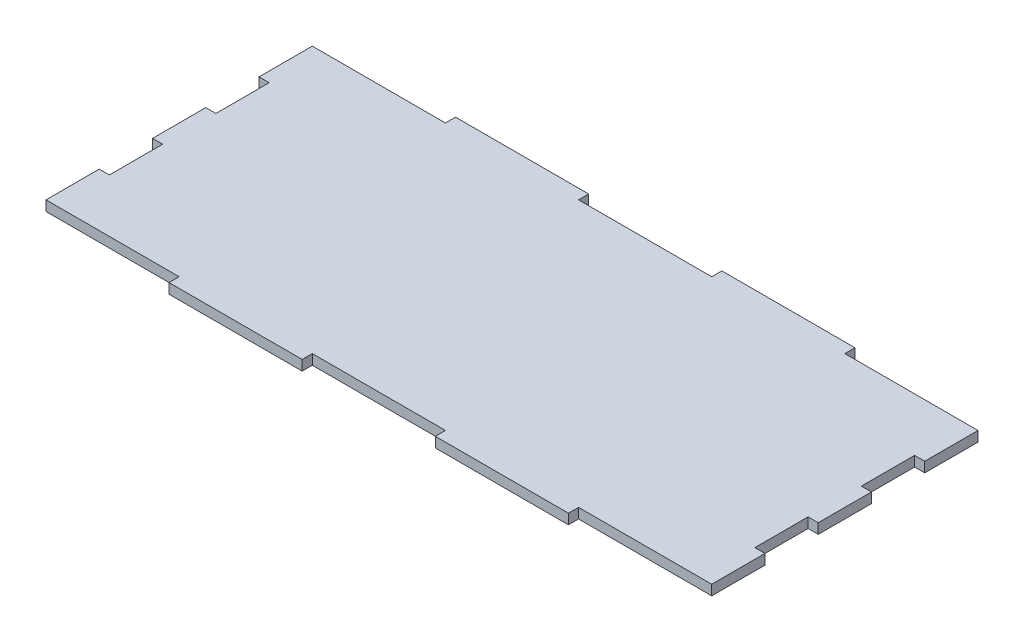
ISO-10303-21;
HEADER;
FILE_DESCRIPTION(('STEP AP214'),'2;1');
FILE_NAME('part.step','',(''),(''),'','','');
FILE_SCHEMA(('AUTOMOTIVE_DESIGN { 1 0 10303 214 1 1 1 1 }'));
ENDSEC;
DATA;
#1=APPLICATION_CONTEXT('core data for automotive mechanical design processes');
#2=APPLICATION_PROTOCOL_DEFINITION('international standard','automotive_design',2000,#1);
#3=PRODUCT_CONTEXT('',#1,'mechanical');
#4=PRODUCT('Part','Part','',(#3));
#5=PRODUCT_RELATED_PRODUCT_CATEGORY('part','',(#4));
#6=PRODUCT_DEFINITION_FORMATION('','',#4);
#7=PRODUCT_DEFINITION_CONTEXT('part definition',#1,'design');
#8=PRODUCT_DEFINITION('design','',#6,#7);
#9=PRODUCT_DEFINITION_SHAPE('','',#8);
#10=(LENGTH_UNIT() NAMED_UNIT(*) SI_UNIT(.MILLI.,.METRE.));
#11=(NAMED_UNIT(*) PLANE_ANGLE_UNIT() SI_UNIT($,.RADIAN.));
#12=(NAMED_UNIT(*) SI_UNIT($,.STERADIAN.) SOLID_ANGLE_UNIT());
#13=UNCERTAINTY_MEASURE_WITH_UNIT(LENGTH_MEASURE(1.E-05),#10,'distance_accuracy_value','');
#14=(GEOMETRIC_REPRESENTATION_CONTEXT(3) GLOBAL_UNCERTAINTY_ASSIGNED_CONTEXT((#13)) GLOBAL_UNIT_ASSIGNED_CONTEXT((#10,
#11,#12)) REPRESENTATION_CONTEXT('',''));
#15=CARTESIAN_POINT('',(0.,0.,0.));
#16=DIRECTION('',(0.,0.,1.));
#17=DIRECTION('',(1.,0.,0.));
#18=AXIS2_PLACEMENT_3D('',#15,#16,#17);
#19=CARTESIAN_POINT('',(75.,2.28,30.));
#20=DIRECTION('',(-1.,0.,0.));
#21=DIRECTION('',(0.,0.,1.));
#22=AXIS2_PLACEMENT_3D('',#19,#20,#21);
#23=PLANE('',#22);
#24=DIRECTION('',(0.,0.,-1.));
#25=VECTOR('',#24,1.);
#26=CARTESIAN_POINT('',(75.,0.,30.));
#27=LINE('',#26,#25);
#28=CARTESIAN_POINT('',(75.,0.,30.));
#29=VERTEX_POINT('',#28);
#30=CARTESIAN_POINT('',(75.,0.,18.));
#31=VERTEX_POINT('',#30);
#32=EDGE_CURVE('E302',#29,#31,#27,.T.);
#33=ORIENTED_EDGE('',*,*,#32,.T.);
#34=DIRECTION('',(0.,-1.,0.));
#35=VECTOR('',#34,1.);
#36=CARTESIAN_POINT('',(75.,2.28,18.));
#37=LINE('',#36,#35);
#38=CARTESIAN_POINT('',(75.,2.28,18.));
#39=VERTEX_POINT('',#38);
#40=EDGE_CURVE('E11',#39,#31,#37,.T.);
#41=ORIENTED_EDGE('',*,*,#40,.F.);
#42=DIRECTION('',(0.,0.,-1.));
#43=VECTOR('',#42,1.);
#44=CARTESIAN_POINT('',(75.,2.28,30.));
#45=LINE('',#44,#43);
#46=CARTESIAN_POINT('',(75.,2.28,30.));
#47=VERTEX_POINT('',#46);
#48=EDGE_CURVE('E373',#47,#39,#45,.T.);
#49=ORIENTED_EDGE('',*,*,#48,.F.);
#50=DIRECTION('',(0.,-1.,0.));
#51=VECTOR('',#50,1.);
#52=CARTESIAN_POINT('',(75.,2.28,30.));
#53=LINE('',#52,#51);
#54=EDGE_CURVE('E298',#47,#29,#53,.T.);
#55=ORIENTED_EDGE('',*,*,#54,.T.);
#56=EDGE_LOOP('',(#33,#41,#49,#55));
#57=FACE_BOUND('',#56,.T.);
#58=ADVANCED_FACE('F37',(#57),#23,.F.);
#59=CARTESIAN_POINT('',(75.,2.28,18.));
#60=DIRECTION('',(0.,0.,1.));
#61=DIRECTION('',(1.,0.,0.));
#62=AXIS2_PLACEMENT_3D('',#59,#60,#61);
#63=PLANE('',#62);
#64=DIRECTION('',(-1.,0.,0.));
#65=VECTOR('',#64,1.);
#66=CARTESIAN_POINT('',(75.,0.,18.));
#67=LINE('',#66,#65);
#68=CARTESIAN_POINT('',(72.72,0.,18.));
#69=VERTEX_POINT('',#68);
#70=EDGE_CURVE('E305',#31,#69,#67,.T.);
#71=ORIENTED_EDGE('',*,*,#70,.T.);
#72=DIRECTION('',(0.,-1.,0.));
#73=VECTOR('',#72,1.);
#74=CARTESIAN_POINT('',(72.72,2.28,18.));
#75=LINE('',#74,#73);
#76=CARTESIAN_POINT('',(72.72,2.28,18.));
#77=VERTEX_POINT('',#76);
#78=EDGE_CURVE('E45',#77,#69,#75,.T.);
#79=ORIENTED_EDGE('',*,*,#78,.F.);
#80=DIRECTION('',(-1.,0.,0.));
#81=VECTOR('',#80,1.);
#82=CARTESIAN_POINT('',(75.,2.28,18.));
#83=LINE('',#82,#81);
#84=EDGE_CURVE('E178',#39,#77,#83,.T.);
#85=ORIENTED_EDGE('',*,*,#84,.F.);
#86=ORIENTED_EDGE('',*,*,#40,.T.);
#87=EDGE_LOOP('',(#71,#79,#85,#86));
#88=FACE_BOUND('',#87,.T.);
#89=ADVANCED_FACE('F561',(#88),#63,.F.);
#90=CARTESIAN_POINT('',(72.72,2.28,18.));
#91=DIRECTION('',(-1.,0.,0.));
#92=DIRECTION('',(0.,0.,1.));
#93=AXIS2_PLACEMENT_3D('',#90,#91,#92);
#94=PLANE('',#93);
#95=DIRECTION('',(0.,0.,-1.));
#96=VECTOR('',#95,1.);
#97=CARTESIAN_POINT('',(72.72,0.,18.));
#98=LINE('',#97,#96);
#99=CARTESIAN_POINT('',(72.72,0.,6.00000000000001));
#100=VERTEX_POINT('',#99);
#101=EDGE_CURVE('E307',#69,#100,#98,.T.);
#102=ORIENTED_EDGE('',*,*,#101,.T.);
#103=DIRECTION('',(0.,-1.,0.));
#104=VECTOR('',#103,1.);
#105=CARTESIAN_POINT('',(72.72,2.28,6.00000000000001));
#106=LINE('',#105,#104);
#107=CARTESIAN_POINT('',(72.72,2.28,6.00000000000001));
#108=VERTEX_POINT('',#107);
#109=EDGE_CURVE('E464',#108,#100,#106,.T.);
#110=ORIENTED_EDGE('',*,*,#109,.F.);
#111=DIRECTION('',(0.,0.,-1.));
#112=VECTOR('',#111,1.);
#113=CARTESIAN_POINT('',(72.72,2.28,18.));
#114=LINE('',#113,#112);
#115=EDGE_CURVE('E472',#77,#108,#114,.T.);
#116=ORIENTED_EDGE('',*,*,#115,.F.);
#117=ORIENTED_EDGE('',*,*,#78,.T.);
#118=EDGE_LOOP('',(#102,#110,#116,#117));
#119=FACE_BOUND('',#118,.T.);
#120=ADVANCED_FACE('F470',(#119),#94,.F.);
#121=CARTESIAN_POINT('',(72.72,2.28,6.00000000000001));
#122=DIRECTION('',(0.,0.,-1.));
#123=DIRECTION('',(-1.,0.,0.));
#124=AXIS2_PLACEMENT_3D('',#121,#122,#123);
#125=PLANE('',#124);
#126=DIRECTION('',(1.,0.,0.));
#127=VECTOR('',#126,1.);
#128=CARTESIAN_POINT('',(72.72,0.,6.00000000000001));
#129=LINE('',#128,#127);
#130=CARTESIAN_POINT('',(75.,0.,6.00000000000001));
#131=VERTEX_POINT('',#130);
#132=EDGE_CURVE('E309',#100,#131,#129,.T.);
#133=ORIENTED_EDGE('',*,*,#132,.T.);
#134=DIRECTION('',(0.,-1.,0.));
#135=VECTOR('',#134,1.);
#136=CARTESIAN_POINT('',(75.,2.28,6.00000000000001));
#137=LINE('',#136,#135);
#138=CARTESIAN_POINT('',(75.,2.28,6.00000000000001));
#139=VERTEX_POINT('',#138);
#140=EDGE_CURVE('E461',#139,#131,#137,.T.);
#141=ORIENTED_EDGE('',*,*,#140,.F.);
#142=DIRECTION('',(1.,0.,0.));
#143=VECTOR('',#142,1.);
#144=CARTESIAN_POINT('',(72.72,2.28,6.00000000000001));
#145=LINE('',#144,#143);
#146=EDGE_CURVE('E488',#108,#139,#145,.T.);
#147=ORIENTED_EDGE('',*,*,#146,.F.);
#148=ORIENTED_EDGE('',*,*,#109,.T.);
#149=EDGE_LOOP('',(#133,#141,#147,#148));
#150=FACE_BOUND('',#149,.T.);
#151=ADVANCED_FACE('F479',(#150),#125,.F.);
#152=CARTESIAN_POINT('',(75.,2.28,6.00000000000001));
#153=DIRECTION('',(-1.,0.,0.));
#154=DIRECTION('',(0.,0.,1.));
#155=AXIS2_PLACEMENT_3D('',#152,#153,#154);
#156=PLANE('',#155);
#157=DIRECTION('',(0.,0.,-1.));
#158=VECTOR('',#157,1.);
#159=CARTESIAN_POINT('',(75.,0.,6.00000000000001));
#160=LINE('',#159,#158);
#161=CARTESIAN_POINT('',(75.,0.,-6.));
#162=VERTEX_POINT('',#161);
#163=EDGE_CURVE('E311',#131,#162,#160,.T.);
#164=ORIENTED_EDGE('',*,*,#163,.T.);
#165=DIRECTION('',(0.,-1.,0.));
#166=VECTOR('',#165,1.);
#167=CARTESIAN_POINT('',(75.,2.28,-6.));
#168=LINE('',#167,#166);
#169=CARTESIAN_POINT('',(75.,2.28,-6.));
#170=VERTEX_POINT('',#169);
#171=EDGE_CURVE('E458',#170,#162,#168,.T.);
#172=ORIENTED_EDGE('',*,*,#171,.F.);
#173=DIRECTION('',(0.,0.,-1.));
#174=VECTOR('',#173,1.);
#175=CARTESIAN_POINT('',(75.,2.28,6.00000000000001));
#176=LINE('',#175,#174);
#177=EDGE_CURVE('E485',#139,#170,#176,.T.);
#178=ORIENTED_EDGE('',*,*,#177,.F.);
#179=ORIENTED_EDGE('',*,*,#140,.T.);
#180=EDGE_LOOP('',(#164,#172,#178,#179));
#181=FACE_BOUND('',#180,.T.);
#182=ADVANCED_FACE('F483',(#181),#156,.F.);
#183=CARTESIAN_POINT('',(75.,2.28,-6.));
#184=DIRECTION('',(0.,0.,1.));
#185=DIRECTION('',(1.,0.,0.));
#186=AXIS2_PLACEMENT_3D('',#183,#184,#185);
#187=PLANE('',#186);
#188=DIRECTION('',(-1.,0.,0.));
#189=VECTOR('',#188,1.);
#190=CARTESIAN_POINT('',(75.,0.,-6.));
#191=LINE('',#190,#189);
#192=CARTESIAN_POINT('',(72.72,0.,-6.));
#193=VERTEX_POINT('',#192);
#194=EDGE_CURVE('E313',#162,#193,#191,.T.);
#195=ORIENTED_EDGE('',*,*,#194,.T.);
#196=DIRECTION('',(0.,-1.,0.));
#197=VECTOR('',#196,1.);
#198=CARTESIAN_POINT('',(72.72,2.28,-6.));
#199=LINE('',#198,#197);
#200=CARTESIAN_POINT('',(72.72,2.28,-6.));
#201=VERTEX_POINT('',#200);
#202=EDGE_CURVE('E455',#201,#193,#199,.T.);
#203=ORIENTED_EDGE('',*,*,#202,.F.);
#204=DIRECTION('',(-1.,0.,0.));
#205=VECTOR('',#204,1.);
#206=CARTESIAN_POINT('',(75.,2.28,-6.));
#207=LINE('',#206,#205);
#208=EDGE_CURVE('E487',#170,#201,#207,.T.);
#209=ORIENTED_EDGE('',*,*,#208,.F.);
#210=ORIENTED_EDGE('',*,*,#171,.T.);
#211=EDGE_LOOP('',(#195,#203,#209,#210));
#212=FACE_BOUND('',#211,.T.);
#213=ADVANCED_FACE('F573',(#212),#187,.F.);
#214=CARTESIAN_POINT('',(72.72,2.28,-6.));
#215=DIRECTION('',(-1.,0.,0.));
#216=DIRECTION('',(0.,0.,1.));
#217=AXIS2_PLACEMENT_3D('',#214,#215,#216);
#218=PLANE('',#217);
#219=DIRECTION('',(0.,0.,-1.));
#220=VECTOR('',#219,1.);
#221=CARTESIAN_POINT('',(72.72,0.,-6.));
#222=LINE('',#221,#220);
#223=CARTESIAN_POINT('',(72.72,0.,-18.));
#224=VERTEX_POINT('',#223);
#225=EDGE_CURVE('E315',#193,#224,#222,.T.);
#226=ORIENTED_EDGE('',*,*,#225,.T.);
#227=DIRECTION('',(0.,-1.,0.));
#228=VECTOR('',#227,1.);
#229=CARTESIAN_POINT('',(72.72,2.28,-18.));
#230=LINE('',#229,#228);
#231=CARTESIAN_POINT('',(72.72,2.28,-18.));
#232=VERTEX_POINT('',#231);
#233=EDGE_CURVE('E452',#232,#224,#230,.T.);
#234=ORIENTED_EDGE('',*,*,#233,.F.);
#235=DIRECTION('',(0.,0.,-1.));
#236=VECTOR('',#235,1.);
#237=CARTESIAN_POINT('',(72.72,2.28,-6.));
#238=LINE('',#237,#236);
#239=EDGE_CURVE('E490',#201,#232,#238,.T.);
#240=ORIENTED_EDGE('',*,*,#239,.F.);
#241=ORIENTED_EDGE('',*,*,#202,.T.);
#242=EDGE_LOOP('',(#226,#234,#240,#241));
#243=FACE_BOUND('',#242,.T.);
#244=ADVANCED_FACE('F576',(#243),#218,.F.);
#245=CARTESIAN_POINT('',(72.72,2.28,-18.));
#246=DIRECTION('',(0.,0.,-1.));
#247=DIRECTION('',(-1.,0.,0.));
#248=AXIS2_PLACEMENT_3D('',#245,#246,#247);
#249=PLANE('',#248);
#250=DIRECTION('',(1.,0.,0.));
#251=VECTOR('',#250,1.);
#252=CARTESIAN_POINT('',(72.72,0.,-18.));
#253=LINE('',#252,#251);
#254=CARTESIAN_POINT('',(75.,0.,-18.));
#255=VERTEX_POINT('',#254);
#256=EDGE_CURVE('E317',#224,#255,#253,.T.);
#257=ORIENTED_EDGE('',*,*,#256,.T.);
#258=DIRECTION('',(0.,-1.,0.));
#259=VECTOR('',#258,1.);
#260=CARTESIAN_POINT('',(75.,2.28,-18.));
#261=LINE('',#260,#259);
#262=CARTESIAN_POINT('',(75.,2.28,-18.));
#263=VERTEX_POINT('',#262);
#264=EDGE_CURVE('E449',#263,#255,#261,.T.);
#265=ORIENTED_EDGE('',*,*,#264,.F.);
#266=DIRECTION('',(1.,0.,0.));
#267=VECTOR('',#266,1.);
#268=CARTESIAN_POINT('',(72.72,2.28,-18.));
#269=LINE('',#268,#267);
#270=EDGE_CURVE('E496',#232,#263,#269,.T.);
#271=ORIENTED_EDGE('',*,*,#270,.F.);
#272=ORIENTED_EDGE('',*,*,#233,.T.);
#273=EDGE_LOOP('',(#257,#265,#271,#272));
#274=FACE_BOUND('',#273,.T.);
#275=ADVANCED_FACE('F580',(#274),#249,.F.);
#276=CARTESIAN_POINT('',(75.,2.28,-18.));
#277=DIRECTION('',(-1.,0.,0.));
#278=DIRECTION('',(0.,0.,1.));
#279=AXIS2_PLACEMENT_3D('',#276,#277,#278);
#280=PLANE('',#279);
#281=DIRECTION('',(0.,0.,-1.));
#282=VECTOR('',#281,1.);
#283=CARTESIAN_POINT('',(75.,0.,-18.));
#284=LINE('',#283,#282);
#285=CARTESIAN_POINT('',(75.,0.,-30.));
#286=VERTEX_POINT('',#285);
#287=EDGE_CURVE('E319',#255,#286,#284,.T.);
#288=ORIENTED_EDGE('',*,*,#287,.T.);
#289=DIRECTION('',(0.,-1.,0.));
#290=VECTOR('',#289,1.);
#291=CARTESIAN_POINT('',(75.,2.28,-30.));
#292=LINE('',#291,#290);
#293=CARTESIAN_POINT('',(75.,2.28,-30.));
#294=VERTEX_POINT('',#293);
#295=EDGE_CURVE('E446',#294,#286,#292,.T.);
#296=ORIENTED_EDGE('',*,*,#295,.F.);
#297=DIRECTION('',(0.,0.,-1.));
#298=VECTOR('',#297,1.);
#299=CARTESIAN_POINT('',(75.,2.28,-18.));
#300=LINE('',#299,#298);
#301=EDGE_CURVE('E498',#263,#294,#300,.T.);
#302=ORIENTED_EDGE('',*,*,#301,.F.);
#303=ORIENTED_EDGE('',*,*,#264,.T.);
#304=EDGE_LOOP('',(#288,#296,#302,#303));
#305=FACE_BOUND('',#304,.T.);
#306=ADVANCED_FACE('F584',(#305),#280,.F.);
#307=CARTESIAN_POINT('',(45.,2.28,-30.));
#308=DIRECTION('',(0.,0.,1.));
#309=DIRECTION('',(1.,0.,0.));
#310=AXIS2_PLACEMENT_3D('',#307,#308,#309);
#311=PLANE('',#310);
#312=DIRECTION('',(-1.,0.,0.));
#313=VECTOR('',#312,1.);
#314=CARTESIAN_POINT('',(45.,0.,-30.));
#315=LINE('',#314,#313);
#316=CARTESIAN_POINT('',(45.,0.,-30.));
#317=VERTEX_POINT('',#316);
#318=EDGE_CURVE('E321',#286,#317,#315,.T.);
#319=ORIENTED_EDGE('',*,*,#318,.T.);
#320=DIRECTION('',(0.,-1.,0.));
#321=VECTOR('',#320,1.);
#322=CARTESIAN_POINT('',(45.,2.28,-30.));
#323=LINE('',#322,#321);
#324=CARTESIAN_POINT('',(45.,2.28,-30.));
#325=VERTEX_POINT('',#324);
#326=EDGE_CURVE('E443',#325,#317,#323,.T.);
#327=ORIENTED_EDGE('',*,*,#326,.F.);
#328=DIRECTION('',(-1.,0.,0.));
#329=VECTOR('',#328,1.);
#330=CARTESIAN_POINT('',(45.,2.28,-30.));
#331=LINE('',#330,#329);
#332=EDGE_CURVE('E500',#294,#325,#331,.T.);
#333=ORIENTED_EDGE('',*,*,#332,.F.);
#334=ORIENTED_EDGE('',*,*,#295,.T.);
#335=EDGE_LOOP('',(#319,#327,#333,#334));
#336=FACE_BOUND('',#335,.T.);
#337=ADVANCED_FACE('F588',(#336),#311,.F.);
#338=CARTESIAN_POINT('',(45.,2.28,-30.));
#339=DIRECTION('',(-1.,0.,0.));
#340=DIRECTION('',(0.,0.,1.));
#341=AXIS2_PLACEMENT_3D('',#338,#339,#340);
#342=PLANE('',#341);
#343=DIRECTION('',(0.,0.,-1.));
#344=VECTOR('',#343,1.);
#345=CARTESIAN_POINT('',(45.,0.,-30.));
#346=LINE('',#345,#344);
#347=CARTESIAN_POINT('',(45.,0.,-32.28));
#348=VERTEX_POINT('',#347);
#349=EDGE_CURVE('E323',#317,#348,#346,.T.);
#350=ORIENTED_EDGE('',*,*,#349,.T.);
#351=DIRECTION('',(0.,-1.,0.));
#352=VECTOR('',#351,1.);
#353=CARTESIAN_POINT('',(45.,2.28,-32.28));
#354=LINE('',#353,#352);
#355=CARTESIAN_POINT('',(45.,2.28,-32.28));
#356=VERTEX_POINT('',#355);
#357=EDGE_CURVE('E440',#356,#348,#354,.T.);
#358=ORIENTED_EDGE('',*,*,#357,.F.);
#359=DIRECTION('',(0.,0.,-1.));
#360=VECTOR('',#359,1.);
#361=CARTESIAN_POINT('',(45.,2.28,-30.));
#362=LINE('',#361,#360);
#363=EDGE_CURVE('E502',#325,#356,#362,.T.);
#364=ORIENTED_EDGE('',*,*,#363,.F.);
#365=ORIENTED_EDGE('',*,*,#326,.T.);
#366=EDGE_LOOP('',(#350,#358,#364,#365));
#367=FACE_BOUND('',#366,.T.);
#368=ADVANCED_FACE('F592',(#367),#342,.F.);
#369=CARTESIAN_POINT('',(45.,2.28,-32.28));
#370=DIRECTION('',(0.,0.,1.));
#371=DIRECTION('',(1.,0.,0.));
#372=AXIS2_PLACEMENT_3D('',#369,#370,#371);
#373=PLANE('',#372);
#374=DIRECTION('',(-1.,0.,0.));
#375=VECTOR('',#374,1.);
#376=CARTESIAN_POINT('',(45.,0.,-32.28));
#377=LINE('',#376,#375);
#378=CARTESIAN_POINT('',(15.,0.,-32.28));
#379=VERTEX_POINT('',#378);
#380=EDGE_CURVE('E325',#348,#379,#377,.T.);
#381=ORIENTED_EDGE('',*,*,#380,.T.);
#382=DIRECTION('',(0.,-1.,0.));
#383=VECTOR('',#382,1.);
#384=CARTESIAN_POINT('',(15.,2.28,-32.28));
#385=LINE('',#384,#383);
#386=CARTESIAN_POINT('',(15.,2.28,-32.28));
#387=VERTEX_POINT('',#386);
#388=EDGE_CURVE('E437',#387,#379,#385,.T.);
#389=ORIENTED_EDGE('',*,*,#388,.F.);
#390=DIRECTION('',(-1.,0.,0.));
#391=VECTOR('',#390,1.);
#392=CARTESIAN_POINT('',(45.,2.28,-32.28));
#393=LINE('',#392,#391);
#394=EDGE_CURVE('E504',#356,#387,#393,.T.);
#395=ORIENTED_EDGE('',*,*,#394,.F.);
#396=ORIENTED_EDGE('',*,*,#357,.T.);
#397=EDGE_LOOP('',(#381,#389,#395,#396));
#398=FACE_BOUND('',#397,.T.);
#399=ADVANCED_FACE('F596',(#398),#373,.F.);
#400=CARTESIAN_POINT('',(15.,2.28,-32.28));
#401=DIRECTION('',(1.,0.,0.));
#402=DIRECTION('',(0.,0.,-1.));
#403=AXIS2_PLACEMENT_3D('',#400,#401,#402);
#404=PLANE('',#403);
#405=DIRECTION('',(0.,0.,1.));
#406=VECTOR('',#405,1.);
#407=CARTESIAN_POINT('',(15.,0.,-32.28));
#408=LINE('',#407,#406);
#409=CARTESIAN_POINT('',(15.,0.,-30.));
#410=VERTEX_POINT('',#409);
#411=EDGE_CURVE('E327',#379,#410,#408,.T.);
#412=ORIENTED_EDGE('',*,*,#411,.T.);
#413=DIRECTION('',(0.,-1.,0.));
#414=VECTOR('',#413,1.);
#415=CARTESIAN_POINT('',(15.,2.28,-30.));
#416=LINE('',#415,#414);
#417=CARTESIAN_POINT('',(15.,2.28,-30.));
#418=VERTEX_POINT('',#417);
#419=EDGE_CURVE('E434',#418,#410,#416,.T.);
#420=ORIENTED_EDGE('',*,*,#419,.F.);
#421=DIRECTION('',(0.,0.,1.));
#422=VECTOR('',#421,1.);
#423=CARTESIAN_POINT('',(15.,2.28,-32.28));
#424=LINE('',#423,#422);
#425=EDGE_CURVE('E506',#387,#418,#424,.T.);
#426=ORIENTED_EDGE('',*,*,#425,.F.);
#427=ORIENTED_EDGE('',*,*,#388,.T.);
#428=EDGE_LOOP('',(#412,#420,#426,#427));
#429=FACE_BOUND('',#428,.T.);
#430=ADVANCED_FACE('F600',(#429),#404,.F.);
#431=CARTESIAN_POINT('',(15.,2.28,-30.));
#432=DIRECTION('',(0.,0.,1.));
#433=DIRECTION('',(1.,0.,0.));
#434=AXIS2_PLACEMENT_3D('',#431,#432,#433);
#435=PLANE('',#434);
#436=DIRECTION('',(-1.,0.,0.));
#437=VECTOR('',#436,1.);
#438=CARTESIAN_POINT('',(15.,0.,-30.));
#439=LINE('',#438,#437);
#440=CARTESIAN_POINT('',(-15.,0.,-30.));
#441=VERTEX_POINT('',#440);
#442=EDGE_CURVE('E329',#410,#441,#439,.T.);
#443=ORIENTED_EDGE('',*,*,#442,.T.);
#444=DIRECTION('',(0.,-1.,0.));
#445=VECTOR('',#444,1.);
#446=CARTESIAN_POINT('',(-15.,2.28,-30.));
#447=LINE('',#446,#445);
#448=CARTESIAN_POINT('',(-15.,2.28,-30.));
#449=VERTEX_POINT('',#448);
#450=EDGE_CURVE('E431',#449,#441,#447,.T.);
#451=ORIENTED_EDGE('',*,*,#450,.F.);
#452=DIRECTION('',(-1.,0.,0.));
#453=VECTOR('',#452,1.);
#454=CARTESIAN_POINT('',(15.,2.28,-30.));
#455=LINE('',#454,#453);
#456=EDGE_CURVE('E508',#418,#449,#455,.T.);
#457=ORIENTED_EDGE('',*,*,#456,.F.);
#458=ORIENTED_EDGE('',*,*,#419,.T.);
#459=EDGE_LOOP('',(#443,#451,#457,#458));
#460=FACE_BOUND('',#459,.T.);
#461=ADVANCED_FACE('F604',(#460),#435,.F.);
#462=CARTESIAN_POINT('',(-15.,2.28,-30.));
#463=DIRECTION('',(-1.,0.,0.));
#464=DIRECTION('',(0.,0.,1.));
#465=AXIS2_PLACEMENT_3D('',#462,#463,#464);
#466=PLANE('',#465);
#467=DIRECTION('',(0.,0.,-1.));
#468=VECTOR('',#467,1.);
#469=CARTESIAN_POINT('',(-15.,0.,-30.));
#470=LINE('',#469,#468);
#471=CARTESIAN_POINT('',(-15.,0.,-32.28));
#472=VERTEX_POINT('',#471);
#473=EDGE_CURVE('E331',#441,#472,#470,.T.);
#474=ORIENTED_EDGE('',*,*,#473,.T.);
#475=DIRECTION('',(0.,-1.,0.));
#476=VECTOR('',#475,1.);
#477=CARTESIAN_POINT('',(-15.,2.28,-32.28));
#478=LINE('',#477,#476);
#479=CARTESIAN_POINT('',(-15.,2.28,-32.28));
#480=VERTEX_POINT('',#479);
#481=EDGE_CURVE('E428',#480,#472,#478,.T.);
#482=ORIENTED_EDGE('',*,*,#481,.F.);
#483=DIRECTION('',(0.,0.,-1.));
#484=VECTOR('',#483,1.);
#485=CARTESIAN_POINT('',(-15.,2.28,-30.));
#486=LINE('',#485,#484);
#487=EDGE_CURVE('E510',#449,#480,#486,.T.);
#488=ORIENTED_EDGE('',*,*,#487,.F.);
#489=ORIENTED_EDGE('',*,*,#450,.T.);
#490=EDGE_LOOP('',(#474,#482,#488,#489));
#491=FACE_BOUND('',#490,.T.);
#492=ADVANCED_FACE('F608',(#491),#466,.F.);
#493=CARTESIAN_POINT('',(-15.,2.28,-32.28));
#494=DIRECTION('',(0.,0.,1.));
#495=DIRECTION('',(1.,0.,0.));
#496=AXIS2_PLACEMENT_3D('',#493,#494,#495);
#497=PLANE('',#496);
#498=DIRECTION('',(-1.,0.,0.));
#499=VECTOR('',#498,1.);
#500=CARTESIAN_POINT('',(-15.,0.,-32.28));
#501=LINE('',#500,#499);
#502=CARTESIAN_POINT('',(-45.,0.,-32.28));
#503=VERTEX_POINT('',#502);
#504=EDGE_CURVE('E333',#472,#503,#501,.T.);
#505=ORIENTED_EDGE('',*,*,#504,.T.);
#506=DIRECTION('',(0.,-1.,0.));
#507=VECTOR('',#506,1.);
#508=CARTESIAN_POINT('',(-45.,2.28,-32.28));
#509=LINE('',#508,#507);
#510=CARTESIAN_POINT('',(-45.,2.28,-32.28));
#511=VERTEX_POINT('',#510);
#512=EDGE_CURVE('E425',#511,#503,#509,.T.);
#513=ORIENTED_EDGE('',*,*,#512,.F.);
#514=DIRECTION('',(-1.,0.,0.));
#515=VECTOR('',#514,1.);
#516=CARTESIAN_POINT('',(-15.,2.28,-32.28));
#517=LINE('',#516,#515);
#518=EDGE_CURVE('E512',#480,#511,#517,.T.);
#519=ORIENTED_EDGE('',*,*,#518,.F.);
#520=ORIENTED_EDGE('',*,*,#481,.T.);
#521=EDGE_LOOP('',(#505,#513,#519,#520));
#522=FACE_BOUND('',#521,.T.);
#523=ADVANCED_FACE('F612',(#522),#497,.F.);
#524=CARTESIAN_POINT('',(-45.,2.28,-32.28));
#525=DIRECTION('',(1.,0.,0.));
#526=DIRECTION('',(0.,0.,-1.));
#527=AXIS2_PLACEMENT_3D('',#524,#525,#526);
#528=PLANE('',#527);
#529=DIRECTION('',(0.,0.,1.));
#530=VECTOR('',#529,1.);
#531=CARTESIAN_POINT('',(-45.,0.,-32.28));
#532=LINE('',#531,#530);
#533=CARTESIAN_POINT('',(-45.,0.,-30.));
#534=VERTEX_POINT('',#533);
#535=EDGE_CURVE('E335',#503,#534,#532,.T.);
#536=ORIENTED_EDGE('',*,*,#535,.T.);
#537=DIRECTION('',(0.,-1.,0.));
#538=VECTOR('',#537,1.);
#539=CARTESIAN_POINT('',(-45.,2.28,-30.));
#540=LINE('',#539,#538);
#541=CARTESIAN_POINT('',(-45.,2.28,-30.));
#542=VERTEX_POINT('',#541);
#543=EDGE_CURVE('E422',#542,#534,#540,.T.);
#544=ORIENTED_EDGE('',*,*,#543,.F.);
#545=DIRECTION('',(0.,0.,1.));
#546=VECTOR('',#545,1.);
#547=CARTESIAN_POINT('',(-45.,2.28,-32.28));
#548=LINE('',#547,#546);
#549=EDGE_CURVE('E514',#511,#542,#548,.T.);
#550=ORIENTED_EDGE('',*,*,#549,.F.);
#551=ORIENTED_EDGE('',*,*,#512,.T.);
#552=EDGE_LOOP('',(#536,#544,#550,#551));
#553=FACE_BOUND('',#552,.T.);
#554=ADVANCED_FACE('F616',(#553),#528,.F.);
#555=CARTESIAN_POINT('',(-45.,2.28,-30.));
#556=DIRECTION('',(0.,0.,1.));
#557=DIRECTION('',(1.,0.,0.));
#558=AXIS2_PLACEMENT_3D('',#555,#556,#557);
#559=PLANE('',#558);
#560=DIRECTION('',(-1.,0.,0.));
#561=VECTOR('',#560,1.);
#562=CARTESIAN_POINT('',(-45.,0.,-30.));
#563=LINE('',#562,#561);
#564=CARTESIAN_POINT('',(-75.0000000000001,0.,-30.));
#565=VERTEX_POINT('',#564);
#566=EDGE_CURVE('E337',#534,#565,#563,.T.);
#567=ORIENTED_EDGE('',*,*,#566,.T.);
#568=DIRECTION('',(0.,-1.,0.));
#569=VECTOR('',#568,1.);
#570=CARTESIAN_POINT('',(-75.0000000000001,2.28,-30.));
#571=LINE('',#570,#569);
#572=CARTESIAN_POINT('',(-75.0000000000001,2.28,-30.));
#573=VERTEX_POINT('',#572);
#574=EDGE_CURVE('E419',#573,#565,#571,.T.);
#575=ORIENTED_EDGE('',*,*,#574,.F.);
#576=DIRECTION('',(-1.,0.,0.));
#577=VECTOR('',#576,1.);
#578=CARTESIAN_POINT('',(-45.,2.28,-30.));
#579=LINE('',#578,#577);
#580=EDGE_CURVE('E516',#542,#573,#579,.T.);
#581=ORIENTED_EDGE('',*,*,#580,.F.);
#582=ORIENTED_EDGE('',*,*,#543,.T.);
#583=EDGE_LOOP('',(#567,#575,#581,#582));
#584=FACE_BOUND('',#583,.T.);
#585=ADVANCED_FACE('F620',(#584),#559,.F.);
#586=CARTESIAN_POINT('',(-75.0000000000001,2.28,-18.));
#587=DIRECTION('',(1.,0.,0.));
#588=DIRECTION('',(0.,0.,-1.));
#589=AXIS2_PLACEMENT_3D('',#586,#587,#588);
#590=PLANE('',#589);
#591=DIRECTION('',(0.,0.,1.));
#592=VECTOR('',#591,1.);
#593=CARTESIAN_POINT('',(-75.0000000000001,0.,-18.));
#594=LINE('',#593,#592);
#595=CARTESIAN_POINT('',(-75.0000000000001,0.,-18.));
#596=VERTEX_POINT('',#595);
#597=EDGE_CURVE('E339',#565,#596,#594,.T.);
#598=ORIENTED_EDGE('',*,*,#597,.T.);
#599=DIRECTION('',(0.,-1.,0.));
#600=VECTOR('',#599,1.);
#601=CARTESIAN_POINT('',(-75.0000000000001,2.28,-18.));
#602=LINE('',#601,#600);
#603=CARTESIAN_POINT('',(-75.0000000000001,2.28,-18.));
#604=VERTEX_POINT('',#603);
#605=EDGE_CURVE('E416',#604,#596,#602,.T.);
#606=ORIENTED_EDGE('',*,*,#605,.F.);
#607=DIRECTION('',(0.,0.,1.));
#608=VECTOR('',#607,1.);
#609=CARTESIAN_POINT('',(-75.0000000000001,2.28,-18.));
#610=LINE('',#609,#608);
#611=EDGE_CURVE('E518',#573,#604,#610,.T.);
#612=ORIENTED_EDGE('',*,*,#611,.F.);
#613=ORIENTED_EDGE('',*,*,#574,.T.);
#614=EDGE_LOOP('',(#598,#606,#612,#613));
#615=FACE_BOUND('',#614,.T.);
#616=ADVANCED_FACE('F624',(#615),#590,.F.);
#617=CARTESIAN_POINT('',(-75.0000000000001,2.28,-18.));
#618=DIRECTION('',(0.,0.,-1.));
#619=DIRECTION('',(-1.,0.,0.));
#620=AXIS2_PLACEMENT_3D('',#617,#618,#619);
#621=PLANE('',#620);
#622=DIRECTION('',(1.,0.,0.));
#623=VECTOR('',#622,1.);
#624=CARTESIAN_POINT('',(-75.0000000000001,0.,-18.));
#625=LINE('',#624,#623);
#626=CARTESIAN_POINT('',(-72.72,0.,-18.));
#627=VERTEX_POINT('',#626);
#628=EDGE_CURVE('E341',#596,#627,#625,.T.);
#629=ORIENTED_EDGE('',*,*,#628,.T.);
#630=DIRECTION('',(0.,-1.,0.));
#631=VECTOR('',#630,1.);
#632=CARTESIAN_POINT('',(-72.72,2.28,-18.));
#633=LINE('',#632,#631);
#634=CARTESIAN_POINT('',(-72.72,2.28,-18.));
#635=VERTEX_POINT('',#634);
#636=EDGE_CURVE('E413',#635,#627,#633,.T.);
#637=ORIENTED_EDGE('',*,*,#636,.F.);
#638=DIRECTION('',(1.,0.,0.));
#639=VECTOR('',#638,1.);
#640=CARTESIAN_POINT('',(-75.0000000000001,2.28,-18.));
#641=LINE('',#640,#639);
#642=EDGE_CURVE('E520',#604,#635,#641,.T.);
#643=ORIENTED_EDGE('',*,*,#642,.F.);
#644=ORIENTED_EDGE('',*,*,#605,.T.);
#645=EDGE_LOOP('',(#629,#637,#643,#644));
#646=FACE_BOUND('',#645,.T.);
#647=ADVANCED_FACE('F628',(#646),#621,.F.);
#648=CARTESIAN_POINT('',(-72.72,2.28,-18.));
#649=DIRECTION('',(1.,0.,0.));
#650=DIRECTION('',(0.,0.,-1.));
#651=AXIS2_PLACEMENT_3D('',#648,#649,#650);
#652=PLANE('',#651);
#653=DIRECTION('',(0.,0.,1.));
#654=VECTOR('',#653,1.);
#655=CARTESIAN_POINT('',(-72.72,0.,-18.));
#656=LINE('',#655,#654);
#657=CARTESIAN_POINT('',(-72.72,0.,-6.));
#658=VERTEX_POINT('',#657);
#659=EDGE_CURVE('E343',#627,#658,#656,.T.);
#660=ORIENTED_EDGE('',*,*,#659,.T.);
#661=DIRECTION('',(0.,-1.,0.));
#662=VECTOR('',#661,1.);
#663=CARTESIAN_POINT('',(-72.72,2.28,-6.));
#664=LINE('',#663,#662);
#665=CARTESIAN_POINT('',(-72.72,2.28,-6.));
#666=VERTEX_POINT('',#665);
#667=EDGE_CURVE('E410',#666,#658,#664,.T.);
#668=ORIENTED_EDGE('',*,*,#667,.F.);
#669=DIRECTION('',(0.,0.,1.));
#670=VECTOR('',#669,1.);
#671=CARTESIAN_POINT('',(-72.72,2.28,-18.));
#672=LINE('',#671,#670);
#673=EDGE_CURVE('E522',#635,#666,#672,.T.);
#674=ORIENTED_EDGE('',*,*,#673,.F.);
#675=ORIENTED_EDGE('',*,*,#636,.T.);
#676=EDGE_LOOP('',(#660,#668,#674,#675));
#677=FACE_BOUND('',#676,.T.);
#678=ADVANCED_FACE('F632',(#677),#652,.F.);
#679=CARTESIAN_POINT('',(-72.72,2.28,-6.));
#680=DIRECTION('',(0.,0.,1.));
#681=DIRECTION('',(1.,0.,0.));
#682=AXIS2_PLACEMENT_3D('',#679,#680,#681);
#683=PLANE('',#682);
#684=DIRECTION('',(-1.,0.,0.));
#685=VECTOR('',#684,1.);
#686=CARTESIAN_POINT('',(-72.72,0.,-6.));
#687=LINE('',#686,#685);
#688=CARTESIAN_POINT('',(-75.,0.,-6.));
#689=VERTEX_POINT('',#688);
#690=EDGE_CURVE('E345',#658,#689,#687,.T.);
#691=ORIENTED_EDGE('',*,*,#690,.T.);
#692=DIRECTION('',(0.,-1.,0.));
#693=VECTOR('',#692,1.);
#694=CARTESIAN_POINT('',(-75.,2.28,-6.));
#695=LINE('',#694,#693);
#696=CARTESIAN_POINT('',(-75.,2.28,-6.));
#697=VERTEX_POINT('',#696);
#698=EDGE_CURVE('E407',#697,#689,#695,.T.);
#699=ORIENTED_EDGE('',*,*,#698,.F.);
#700=DIRECTION('',(-1.,0.,0.));
#701=VECTOR('',#700,1.);
#702=CARTESIAN_POINT('',(-72.72,2.28,-6.));
#703=LINE('',#702,#701);
#704=EDGE_CURVE('E524',#666,#697,#703,.T.);
#705=ORIENTED_EDGE('',*,*,#704,.F.);
#706=ORIENTED_EDGE('',*,*,#667,.T.);
#707=EDGE_LOOP('',(#691,#699,#705,#706));
#708=FACE_BOUND('',#707,.T.);
#709=ADVANCED_FACE('F636',(#708),#683,.F.);
#710=CARTESIAN_POINT('',(-75.,2.28,-6.));
#711=DIRECTION('',(1.,0.,0.));
#712=DIRECTION('',(0.,0.,-1.));
#713=AXIS2_PLACEMENT_3D('',#710,#711,#712);
#714=PLANE('',#713);
#715=DIRECTION('',(0.,0.,1.));
#716=VECTOR('',#715,1.);
#717=CARTESIAN_POINT('',(-75.,0.,-6.));
#718=LINE('',#717,#716);
#719=CARTESIAN_POINT('',(-75.,0.,6.00000000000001));
#720=VERTEX_POINT('',#719);
#721=EDGE_CURVE('E347',#689,#720,#718,.T.);
#722=ORIENTED_EDGE('',*,*,#721,.T.);
#723=DIRECTION('',(0.,-1.,0.));
#724=VECTOR('',#723,1.);
#725=CARTESIAN_POINT('',(-75.,2.28,6.00000000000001));
#726=LINE('',#725,#724);
#727=CARTESIAN_POINT('',(-75.,2.28,6.00000000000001));
#728=VERTEX_POINT('',#727);
#729=EDGE_CURVE('E404',#728,#720,#726,.T.);
#730=ORIENTED_EDGE('',*,*,#729,.F.);
#731=DIRECTION('',(0.,0.,1.));
#732=VECTOR('',#731,1.);
#733=CARTESIAN_POINT('',(-75.,2.28,-6.));
#734=LINE('',#733,#732);
#735=EDGE_CURVE('E526',#697,#728,#734,.T.);
#736=ORIENTED_EDGE('',*,*,#735,.F.);
#737=ORIENTED_EDGE('',*,*,#698,.T.);
#738=EDGE_LOOP('',(#722,#730,#736,#737));
#739=FACE_BOUND('',#738,.T.);
#740=ADVANCED_FACE('F640',(#739),#714,.F.);
#741=CARTESIAN_POINT('',(-75.,2.28,6.00000000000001));
#742=DIRECTION('',(0.,0.,-1.));
#743=DIRECTION('',(-1.,0.,0.));
#744=AXIS2_PLACEMENT_3D('',#741,#742,#743);
#745=PLANE('',#744);
#746=DIRECTION('',(1.,0.,0.));
#747=VECTOR('',#746,1.);
#748=CARTESIAN_POINT('',(-75.,0.,6.00000000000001));
#749=LINE('',#748,#747);
#750=CARTESIAN_POINT('',(-72.72,0.,6.00000000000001));
#751=VERTEX_POINT('',#750);
#752=EDGE_CURVE('E349',#720,#751,#749,.T.);
#753=ORIENTED_EDGE('',*,*,#752,.T.);
#754=DIRECTION('',(0.,-1.,0.));
#755=VECTOR('',#754,1.);
#756=CARTESIAN_POINT('',(-72.72,2.28,6.00000000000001));
#757=LINE('',#756,#755);
#758=CARTESIAN_POINT('',(-72.72,2.28,6.00000000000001));
#759=VERTEX_POINT('',#758);
#760=EDGE_CURVE('E401',#759,#751,#757,.T.);
#761=ORIENTED_EDGE('',*,*,#760,.F.);
#762=DIRECTION('',(1.,0.,0.));
#763=VECTOR('',#762,1.);
#764=CARTESIAN_POINT('',(-75.,2.28,6.00000000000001));
#765=LINE('',#764,#763);
#766=EDGE_CURVE('E528',#728,#759,#765,.T.);
#767=ORIENTED_EDGE('',*,*,#766,.F.);
#768=ORIENTED_EDGE('',*,*,#729,.T.);
#769=EDGE_LOOP('',(#753,#761,#767,#768));
#770=FACE_BOUND('',#769,.T.);
#771=ADVANCED_FACE('F644',(#770),#745,.F.);
#772=CARTESIAN_POINT('',(-72.72,2.28,6.00000000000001));
#773=DIRECTION('',(1.,0.,0.));
#774=DIRECTION('',(0.,0.,-1.));
#775=AXIS2_PLACEMENT_3D('',#772,#773,#774);
#776=PLANE('',#775);
#777=DIRECTION('',(0.,0.,1.));
#778=VECTOR('',#777,1.);
#779=CARTESIAN_POINT('',(-72.72,0.,6.00000000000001));
#780=LINE('',#779,#778);
#781=CARTESIAN_POINT('',(-72.72,0.,18.));
#782=VERTEX_POINT('',#781);
#783=EDGE_CURVE('E351',#751,#782,#780,.T.);
#784=ORIENTED_EDGE('',*,*,#783,.T.);
#785=DIRECTION('',(0.,-1.,0.));
#786=VECTOR('',#785,1.);
#787=CARTESIAN_POINT('',(-72.72,2.28,18.));
#788=LINE('',#787,#786);
#789=CARTESIAN_POINT('',(-72.72,2.28,18.));
#790=VERTEX_POINT('',#789);
#791=EDGE_CURVE('E398',#790,#782,#788,.T.);
#792=ORIENTED_EDGE('',*,*,#791,.F.);
#793=DIRECTION('',(0.,0.,1.));
#794=VECTOR('',#793,1.);
#795=CARTESIAN_POINT('',(-72.72,2.28,6.00000000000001));
#796=LINE('',#795,#794);
#797=EDGE_CURVE('E530',#759,#790,#796,.T.);
#798=ORIENTED_EDGE('',*,*,#797,.F.);
#799=ORIENTED_EDGE('',*,*,#760,.T.);
#800=EDGE_LOOP('',(#784,#792,#798,#799));
#801=FACE_BOUND('',#800,.T.);
#802=ADVANCED_FACE('F648',(#801),#776,.F.);
#803=CARTESIAN_POINT('',(-72.72,2.28,18.));
#804=DIRECTION('',(0.,0.,1.));
#805=DIRECTION('',(1.,0.,0.));
#806=AXIS2_PLACEMENT_3D('',#803,#804,#805);
#807=PLANE('',#806);
#808=DIRECTION('',(-1.,0.,0.));
#809=VECTOR('',#808,1.);
#810=CARTESIAN_POINT('',(-72.72,0.,18.));
#811=LINE('',#810,#809);
#812=CARTESIAN_POINT('',(-75.,0.,18.));
#813=VERTEX_POINT('',#812);
#814=EDGE_CURVE('E353',#782,#813,#811,.T.);
#815=ORIENTED_EDGE('',*,*,#814,.T.);
#816=DIRECTION('',(0.,-1.,0.));
#817=VECTOR('',#816,1.);
#818=CARTESIAN_POINT('',(-75.,2.28,18.));
#819=LINE('',#818,#817);
#820=CARTESIAN_POINT('',(-75.,2.28,18.));
#821=VERTEX_POINT('',#820);
#822=EDGE_CURVE('E395',#821,#813,#819,.T.);
#823=ORIENTED_EDGE('',*,*,#822,.F.);
#824=DIRECTION('',(-1.,0.,0.));
#825=VECTOR('',#824,1.);
#826=CARTESIAN_POINT('',(-72.72,2.28,18.));
#827=LINE('',#826,#825);
#828=EDGE_CURVE('E532',#790,#821,#827,.T.);
#829=ORIENTED_EDGE('',*,*,#828,.F.);
#830=ORIENTED_EDGE('',*,*,#791,.T.);
#831=EDGE_LOOP('',(#815,#823,#829,#830));
#832=FACE_BOUND('',#831,.T.);
#833=ADVANCED_FACE('F652',(#832),#807,.F.);
#834=CARTESIAN_POINT('',(-75.,2.28,18.));
#835=DIRECTION('',(1.,0.,0.));
#836=DIRECTION('',(0.,0.,-1.));
#837=AXIS2_PLACEMENT_3D('',#834,#835,#836);
#838=PLANE('',#837);
#839=DIRECTION('',(0.,0.,1.));
#840=VECTOR('',#839,1.);
#841=CARTESIAN_POINT('',(-75.,0.,18.));
#842=LINE('',#841,#840);
#843=CARTESIAN_POINT('',(-75.,0.,30.));
#844=VERTEX_POINT('',#843);
#845=EDGE_CURVE('E355',#813,#844,#842,.T.);
#846=ORIENTED_EDGE('',*,*,#845,.T.);
#847=DIRECTION('',(0.,-1.,0.));
#848=VECTOR('',#847,1.);
#849=CARTESIAN_POINT('',(-75.,2.28,30.));
#850=LINE('',#849,#848);
#851=CARTESIAN_POINT('',(-75.,2.28,30.));
#852=VERTEX_POINT('',#851);
#853=EDGE_CURVE('E392',#852,#844,#850,.T.);
#854=ORIENTED_EDGE('',*,*,#853,.F.);
#855=DIRECTION('',(0.,0.,1.));
#856=VECTOR('',#855,1.);
#857=CARTESIAN_POINT('',(-75.,2.28,18.));
#858=LINE('',#857,#856);
#859=EDGE_CURVE('E534',#821,#852,#858,.T.);
#860=ORIENTED_EDGE('',*,*,#859,.F.);
#861=ORIENTED_EDGE('',*,*,#822,.T.);
#862=EDGE_LOOP('',(#846,#854,#860,#861));
#863=FACE_BOUND('',#862,.T.);
#864=ADVANCED_FACE('F656',(#863),#838,.F.);
#865=CARTESIAN_POINT('',(-75.,2.28,30.));
#866=DIRECTION('',(0.,0.,-1.));
#867=DIRECTION('',(-1.,0.,0.));
#868=AXIS2_PLACEMENT_3D('',#865,#866,#867);
#869=PLANE('',#868);
#870=DIRECTION('',(1.,0.,0.));
#871=VECTOR('',#870,1.);
#872=CARTESIAN_POINT('',(-75.,0.,30.));
#873=LINE('',#872,#871);
#874=CARTESIAN_POINT('',(-45.,0.,30.));
#875=VERTEX_POINT('',#874);
#876=EDGE_CURVE('E357',#844,#875,#873,.T.);
#877=ORIENTED_EDGE('',*,*,#876,.T.);
#878=DIRECTION('',(0.,-1.,0.));
#879=VECTOR('',#878,1.);
#880=CARTESIAN_POINT('',(-45.,2.28,30.));
#881=LINE('',#880,#879);
#882=CARTESIAN_POINT('',(-45.,2.28,30.));
#883=VERTEX_POINT('',#882);
#884=EDGE_CURVE('E389',#883,#875,#881,.T.);
#885=ORIENTED_EDGE('',*,*,#884,.F.);
#886=DIRECTION('',(1.,0.,0.));
#887=VECTOR('',#886,1.);
#888=CARTESIAN_POINT('',(-75.,2.28,30.));
#889=LINE('',#888,#887);
#890=EDGE_CURVE('E536',#852,#883,#889,.T.);
#891=ORIENTED_EDGE('',*,*,#890,.F.);
#892=ORIENTED_EDGE('',*,*,#853,.T.);
#893=EDGE_LOOP('',(#877,#885,#891,#892));
#894=FACE_BOUND('',#893,.T.);
#895=ADVANCED_FACE('F660',(#894),#869,.F.);
#896=CARTESIAN_POINT('',(-45.,2.28,30.));
#897=DIRECTION('',(1.,0.,0.));
#898=DIRECTION('',(0.,0.,-1.));
#899=AXIS2_PLACEMENT_3D('',#896,#897,#898);
#900=PLANE('',#899);
#901=DIRECTION('',(0.,0.,1.));
#902=VECTOR('',#901,1.);
#903=CARTESIAN_POINT('',(-45.,0.,30.));
#904=LINE('',#903,#902);
#905=CARTESIAN_POINT('',(-45.,0.,32.28));
#906=VERTEX_POINT('',#905);
#907=EDGE_CURVE('E359',#875,#906,#904,.T.);
#908=ORIENTED_EDGE('',*,*,#907,.T.);
#909=DIRECTION('',(0.,-1.,0.));
#910=VECTOR('',#909,1.);
#911=CARTESIAN_POINT('',(-45.,2.28,32.28));
#912=LINE('',#911,#910);
#913=CARTESIAN_POINT('',(-45.,2.28,32.28));
#914=VERTEX_POINT('',#913);
#915=EDGE_CURVE('E386',#914,#906,#912,.T.);
#916=ORIENTED_EDGE('',*,*,#915,.F.);
#917=DIRECTION('',(0.,0.,1.));
#918=VECTOR('',#917,1.);
#919=CARTESIAN_POINT('',(-45.,2.28,30.));
#920=LINE('',#919,#918);
#921=EDGE_CURVE('E538',#883,#914,#920,.T.);
#922=ORIENTED_EDGE('',*,*,#921,.F.);
#923=ORIENTED_EDGE('',*,*,#884,.T.);
#924=EDGE_LOOP('',(#908,#916,#922,#923));
#925=FACE_BOUND('',#924,.T.);
#926=ADVANCED_FACE('F664',(#925),#900,.F.);
#927=CARTESIAN_POINT('',(-45.,2.28,32.28));
#928=DIRECTION('',(0.,0.,-1.));
#929=DIRECTION('',(-1.,0.,0.));
#930=AXIS2_PLACEMENT_3D('',#927,#928,#929);
#931=PLANE('',#930);
#932=DIRECTION('',(1.,0.,0.));
#933=VECTOR('',#932,1.);
#934=CARTESIAN_POINT('',(-45.,0.,32.28));
#935=LINE('',#934,#933);
#936=CARTESIAN_POINT('',(-15.,0.,32.28));
#937=VERTEX_POINT('',#936);
#938=EDGE_CURVE('E361',#906,#937,#935,.T.);
#939=ORIENTED_EDGE('',*,*,#938,.T.);
#940=DIRECTION('',(0.,-1.,0.));
#941=VECTOR('',#940,1.);
#942=CARTESIAN_POINT('',(-15.,2.28,32.28));
#943=LINE('',#942,#941);
#944=CARTESIAN_POINT('',(-15.,2.28,32.28));
#945=VERTEX_POINT('',#944);
#946=EDGE_CURVE('E383',#945,#937,#943,.T.);
#947=ORIENTED_EDGE('',*,*,#946,.F.);
#948=DIRECTION('',(1.,0.,0.));
#949=VECTOR('',#948,1.);
#950=CARTESIAN_POINT('',(-45.,2.28,32.28));
#951=LINE('',#950,#949);
#952=EDGE_CURVE('E540',#914,#945,#951,.T.);
#953=ORIENTED_EDGE('',*,*,#952,.F.);
#954=ORIENTED_EDGE('',*,*,#915,.T.);
#955=EDGE_LOOP('',(#939,#947,#953,#954));
#956=FACE_BOUND('',#955,.T.);
#957=ADVANCED_FACE('F668',(#956),#931,.F.);
#958=CARTESIAN_POINT('',(-15.,2.28,32.28));
#959=DIRECTION('',(-1.,0.,0.));
#960=DIRECTION('',(0.,0.,1.));
#961=AXIS2_PLACEMENT_3D('',#958,#959,#960);
#962=PLANE('',#961);
#963=DIRECTION('',(0.,0.,-1.));
#964=VECTOR('',#963,1.);
#965=CARTESIAN_POINT('',(-15.,0.,32.28));
#966=LINE('',#965,#964);
#967=CARTESIAN_POINT('',(-15.,0.,30.));
#968=VERTEX_POINT('',#967);
#969=EDGE_CURVE('E363',#937,#968,#966,.T.);
#970=ORIENTED_EDGE('',*,*,#969,.T.);
#971=DIRECTION('',(0.,-1.,0.));
#972=VECTOR('',#971,1.);
#973=CARTESIAN_POINT('',(-15.,2.28,30.));
#974=LINE('',#973,#972);
#975=CARTESIAN_POINT('',(-15.,2.28,30.));
#976=VERTEX_POINT('',#975);
#977=EDGE_CURVE('E380',#976,#968,#974,.T.);
#978=ORIENTED_EDGE('',*,*,#977,.F.);
#979=DIRECTION('',(0.,0.,-1.));
#980=VECTOR('',#979,1.);
#981=CARTESIAN_POINT('',(-15.,2.28,32.28));
#982=LINE('',#981,#980);
#983=EDGE_CURVE('E542',#945,#976,#982,.T.);
#984=ORIENTED_EDGE('',*,*,#983,.F.);
#985=ORIENTED_EDGE('',*,*,#946,.T.);
#986=EDGE_LOOP('',(#970,#978,#984,#985));
#987=FACE_BOUND('',#986,.T.);
#988=ADVANCED_FACE('F672',(#987),#962,.F.);
#989=CARTESIAN_POINT('',(-15.,2.28,30.));
#990=DIRECTION('',(0.,0.,-1.));
#991=DIRECTION('',(-1.,0.,0.));
#992=AXIS2_PLACEMENT_3D('',#989,#990,#991);
#993=PLANE('',#992);
#994=DIRECTION('',(1.,0.,0.));
#995=VECTOR('',#994,1.);
#996=CARTESIAN_POINT('',(-15.,0.,30.));
#997=LINE('',#996,#995);
#998=CARTESIAN_POINT('',(15.,0.,30.));
#999=VERTEX_POINT('',#998);
#1000=EDGE_CURVE('E365',#968,#999,#997,.T.);
#1001=ORIENTED_EDGE('',*,*,#1000,.T.);
#1002=DIRECTION('',(0.,-1.,0.));
#1003=VECTOR('',#1002,1.);
#1004=CARTESIAN_POINT('',(15.,2.28,30.));
#1005=LINE('',#1004,#1003);
#1006=CARTESIAN_POINT('',(15.,2.28,30.));
#1007=VERTEX_POINT('',#1006);
#1008=EDGE_CURVE('E377',#1007,#999,#1005,.T.);
#1009=ORIENTED_EDGE('',*,*,#1008,.F.);
#1010=DIRECTION('',(1.,0.,0.));
#1011=VECTOR('',#1010,1.);
#1012=CARTESIAN_POINT('',(-15.,2.28,30.));
#1013=LINE('',#1012,#1011);
#1014=EDGE_CURVE('E544',#976,#1007,#1013,.T.);
#1015=ORIENTED_EDGE('',*,*,#1014,.F.);
#1016=ORIENTED_EDGE('',*,*,#977,.T.);
#1017=EDGE_LOOP('',(#1001,#1009,#1015,#1016));
#1018=FACE_BOUND('',#1017,.T.);
#1019=ADVANCED_FACE('F550',(#1018),#993,.F.);
#1020=CARTESIAN_POINT('',(15.,2.28,30.));
#1021=DIRECTION('',(1.,0.,0.));
#1022=DIRECTION('',(0.,0.,-1.));
#1023=AXIS2_PLACEMENT_3D('',#1020,#1021,#1022);
#1024=PLANE('',#1023);
#1025=DIRECTION('',(0.,0.,1.));
#1026=VECTOR('',#1025,1.);
#1027=CARTESIAN_POINT('',(15.,0.,30.));
#1028=LINE('',#1027,#1026);
#1029=CARTESIAN_POINT('',(15.,0.,32.28));
#1030=VERTEX_POINT('',#1029);
#1031=EDGE_CURVE('E367',#999,#1030,#1028,.T.);
#1032=ORIENTED_EDGE('',*,*,#1031,.T.);
#1033=DIRECTION('',(0.,-1.,0.));
#1034=VECTOR('',#1033,1.);
#1035=CARTESIAN_POINT('',(15.,2.28,32.28));
#1036=LINE('',#1035,#1034);
#1037=CARTESIAN_POINT('',(15.,2.28,32.28));
#1038=VERTEX_POINT('',#1037);
#1039=EDGE_CURVE('E293',#1038,#1030,#1036,.T.);
#1040=ORIENTED_EDGE('',*,*,#1039,.F.);
#1041=DIRECTION('',(0.,0.,1.));
#1042=VECTOR('',#1041,1.);
#1043=CARTESIAN_POINT('',(15.,2.28,30.));
#1044=LINE('',#1043,#1042);
#1045=EDGE_CURVE('E282',#1007,#1038,#1044,.T.);
#1046=ORIENTED_EDGE('',*,*,#1045,.F.);
#1047=ORIENTED_EDGE('',*,*,#1008,.T.);
#1048=EDGE_LOOP('',(#1032,#1040,#1046,#1047));
#1049=FACE_BOUND('',#1048,.T.);
#1050=ADVANCED_FACE('F554',(#1049),#1024,.F.);
#1051=CARTESIAN_POINT('',(15.,2.28,32.28));
#1052=DIRECTION('',(0.,0.,-1.));
#1053=DIRECTION('',(-1.,0.,0.));
#1054=AXIS2_PLACEMENT_3D('',#1051,#1052,#1053);
#1055=PLANE('',#1054);
#1056=DIRECTION('',(1.,0.,0.));
#1057=VECTOR('',#1056,1.);
#1058=CARTESIAN_POINT('',(15.,0.,32.28));
#1059=LINE('',#1058,#1057);
#1060=CARTESIAN_POINT('',(45.,0.,32.28));
#1061=VERTEX_POINT('',#1060);
#1062=EDGE_CURVE('E291',#1030,#1061,#1059,.T.);
#1063=ORIENTED_EDGE('',*,*,#1062,.T.);
#1064=DIRECTION('',(0.,-1.,0.));
#1065=VECTOR('',#1064,1.);
#1066=CARTESIAN_POINT('',(45.,2.28,32.28));
#1067=LINE('',#1066,#1065);
#1068=CARTESIAN_POINT('',(45.,2.28,32.28));
#1069=VERTEX_POINT('',#1068);
#1070=EDGE_CURVE('E288',#1069,#1061,#1067,.T.);
#1071=ORIENTED_EDGE('',*,*,#1070,.F.);
#1072=DIRECTION('',(1.,0.,0.));
#1073=VECTOR('',#1072,1.);
#1074=CARTESIAN_POINT('',(15.,2.28,32.28));
#1075=LINE('',#1074,#1073);
#1076=EDGE_CURVE('E275',#1038,#1069,#1075,.T.);
#1077=ORIENTED_EDGE('',*,*,#1076,.F.);
#1078=ORIENTED_EDGE('',*,*,#1039,.T.);
#1079=EDGE_LOOP('',(#1063,#1071,#1077,#1078));
#1080=FACE_BOUND('',#1079,.T.);
#1081=ADVANCED_FACE('F289',(#1080),#1055,.F.);
#1082=CARTESIAN_POINT('',(45.,2.28,32.28));
#1083=DIRECTION('',(-1.,0.,0.));
#1084=DIRECTION('',(0.,0.,1.));
#1085=AXIS2_PLACEMENT_3D('',#1082,#1083,#1084);
#1086=PLANE('',#1085);
#1087=DIRECTION('',(0.,0.,-1.));
#1088=VECTOR('',#1087,1.);
#1089=CARTESIAN_POINT('',(45.,0.,32.28));
#1090=LINE('',#1089,#1088);
#1091=CARTESIAN_POINT('',(45.,0.,30.));
#1092=VERTEX_POINT('',#1091);
#1093=EDGE_CURVE('E370',#1061,#1092,#1090,.T.);
#1094=ORIENTED_EDGE('',*,*,#1093,.T.);
#1095=DIRECTION('',(0.,-1.,0.));
#1096=VECTOR('',#1095,1.);
#1097=CARTESIAN_POINT('',(45.,2.28,30.));
#1098=LINE('',#1097,#1096);
#1099=CARTESIAN_POINT('',(45.,2.28,30.));
#1100=VERTEX_POINT('',#1099);
#1101=EDGE_CURVE('E294',#1100,#1092,#1098,.T.);
#1102=ORIENTED_EDGE('',*,*,#1101,.F.);
#1103=DIRECTION('',(0.,0.,-1.));
#1104=VECTOR('',#1103,1.);
#1105=CARTESIAN_POINT('',(45.,2.28,32.28));
#1106=LINE('',#1105,#1104);
#1107=EDGE_CURVE('E279',#1069,#1100,#1106,.T.);
#1108=ORIENTED_EDGE('',*,*,#1107,.F.);
#1109=ORIENTED_EDGE('',*,*,#1070,.T.);
#1110=EDGE_LOOP('',(#1094,#1102,#1108,#1109));
#1111=FACE_BOUND('',#1110,.T.);
#1112=ADVANCED_FACE('F296',(#1111),#1086,.F.);
#1113=CARTESIAN_POINT('',(74.5584064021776,2.28,30.));
#1114=DIRECTION('',(0.,0.,-1.));
#1115=DIRECTION('',(-1.,0.,0.));
#1116=AXIS2_PLACEMENT_3D('',#1113,#1114,#1115);
#1117=PLANE('',#1116);
#1118=DIRECTION('',(1.,0.,0.));
#1119=VECTOR('',#1118,1.);
#1120=CARTESIAN_POINT('',(74.5584064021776,0.,30.));
#1121=LINE('',#1120,#1119);
#1122=EDGE_CURVE('E166',#1092,#29,#1121,.T.);
#1123=ORIENTED_EDGE('',*,*,#1122,.T.);
#1124=ORIENTED_EDGE('',*,*,#54,.F.);
#1125=DIRECTION('',(1.,0.,0.));
#1126=VECTOR('',#1125,1.);
#1127=CARTESIAN_POINT('',(45.,2.28,30.));
#1128=LINE('',#1127,#1126);
#1129=EDGE_CURVE('E53',#1100,#47,#1128,.T.);
#1130=ORIENTED_EDGE('',*,*,#1129,.F.);
#1131=ORIENTED_EDGE('',*,*,#1101,.T.);
#1132=EDGE_LOOP('',(#1123,#1124,#1130,#1131));
#1133=FACE_BOUND('',#1132,.T.);
#1134=ADVANCED_FACE('F555',(#1133),#1117,.F.);
#1135=CARTESIAN_POINT('',(0.,2.28,0.));
#1136=DIRECTION('',(0.,1.,0.));
#1137=DIRECTION('',(0.,0.,1.));
#1138=AXIS2_PLACEMENT_3D('',#1135,#1136,#1137);
#1139=PLANE('',#1138);
#1140=ORIENTED_EDGE('',*,*,#48,.T.);
#1141=ORIENTED_EDGE('',*,*,#84,.T.);
#1142=ORIENTED_EDGE('',*,*,#115,.T.);
#1143=ORIENTED_EDGE('',*,*,#146,.T.);
#1144=ORIENTED_EDGE('',*,*,#177,.T.);
#1145=ORIENTED_EDGE('',*,*,#208,.T.);
#1146=ORIENTED_EDGE('',*,*,#239,.T.);
#1147=ORIENTED_EDGE('',*,*,#270,.T.);
#1148=ORIENTED_EDGE('',*,*,#301,.T.);
#1149=ORIENTED_EDGE('',*,*,#332,.T.);
#1150=ORIENTED_EDGE('',*,*,#363,.T.);
#1151=ORIENTED_EDGE('',*,*,#394,.T.);
#1152=ORIENTED_EDGE('',*,*,#425,.T.);
#1153=ORIENTED_EDGE('',*,*,#456,.T.);
#1154=ORIENTED_EDGE('',*,*,#487,.T.);
#1155=ORIENTED_EDGE('',*,*,#518,.T.);
#1156=ORIENTED_EDGE('',*,*,#549,.T.);
#1157=ORIENTED_EDGE('',*,*,#580,.T.);
#1158=ORIENTED_EDGE('',*,*,#611,.T.);
#1159=ORIENTED_EDGE('',*,*,#642,.T.);
#1160=ORIENTED_EDGE('',*,*,#673,.T.);
#1161=ORIENTED_EDGE('',*,*,#704,.T.);
#1162=ORIENTED_EDGE('',*,*,#735,.T.);
#1163=ORIENTED_EDGE('',*,*,#766,.T.);
#1164=ORIENTED_EDGE('',*,*,#797,.T.);
#1165=ORIENTED_EDGE('',*,*,#828,.T.);
#1166=ORIENTED_EDGE('',*,*,#859,.T.);
#1167=ORIENTED_EDGE('',*,*,#890,.T.);
#1168=ORIENTED_EDGE('',*,*,#921,.T.);
#1169=ORIENTED_EDGE('',*,*,#952,.T.);
#1170=ORIENTED_EDGE('',*,*,#983,.T.);
#1171=ORIENTED_EDGE('',*,*,#1014,.T.);
#1172=ORIENTED_EDGE('',*,*,#1045,.T.);
#1173=ORIENTED_EDGE('',*,*,#1076,.T.);
#1174=ORIENTED_EDGE('',*,*,#1107,.T.);
#1175=ORIENTED_EDGE('',*,*,#1129,.T.);
#1176=EDGE_LOOP('',(#1140,#1141,#1142,#1143,#1144,#1145,#1146,#1147,#1148,#1149,#1150,#1151,
#1152,#1153,#1154,#1155,#1156,#1157,#1158,#1159,#1160,#1161,#1162,#1163,#1164,#1165,#1166,#1167,
#1168,#1169,#1170,#1171,#1172,#1173,#1174,#1175));
#1177=FACE_BOUND('',#1176,.T.);
#1178=ADVANCED_FACE('F277',(#1177),#1139,.T.);
#1179=CARTESIAN_POINT('',(0.,0.,0.));
#1180=DIRECTION('',(0.,1.,0.));
#1181=DIRECTION('',(0.,0.,1.));
#1182=AXIS2_PLACEMENT_3D('',#1179,#1180,#1181);
#1183=PLANE('',#1182);
#1184=ORIENTED_EDGE('',*,*,#32,.F.);
#1185=ORIENTED_EDGE('',*,*,#1122,.F.);
#1186=ORIENTED_EDGE('',*,*,#1093,.F.);
#1187=ORIENTED_EDGE('',*,*,#1062,.F.);
#1188=ORIENTED_EDGE('',*,*,#1031,.F.);
#1189=ORIENTED_EDGE('',*,*,#1000,.F.);
#1190=ORIENTED_EDGE('',*,*,#969,.F.);
#1191=ORIENTED_EDGE('',*,*,#938,.F.);
#1192=ORIENTED_EDGE('',*,*,#907,.F.);
#1193=ORIENTED_EDGE('',*,*,#876,.F.);
#1194=ORIENTED_EDGE('',*,*,#845,.F.);
#1195=ORIENTED_EDGE('',*,*,#814,.F.);
#1196=ORIENTED_EDGE('',*,*,#783,.F.);
#1197=ORIENTED_EDGE('',*,*,#752,.F.);
#1198=ORIENTED_EDGE('',*,*,#721,.F.);
#1199=ORIENTED_EDGE('',*,*,#690,.F.);
#1200=ORIENTED_EDGE('',*,*,#659,.F.);
#1201=ORIENTED_EDGE('',*,*,#628,.F.);
#1202=ORIENTED_EDGE('',*,*,#597,.F.);
#1203=ORIENTED_EDGE('',*,*,#566,.F.);
#1204=ORIENTED_EDGE('',*,*,#535,.F.);
#1205=ORIENTED_EDGE('',*,*,#504,.F.);
#1206=ORIENTED_EDGE('',*,*,#473,.F.);
#1207=ORIENTED_EDGE('',*,*,#442,.F.);
#1208=ORIENTED_EDGE('',*,*,#411,.F.);
#1209=ORIENTED_EDGE('',*,*,#380,.F.);
#1210=ORIENTED_EDGE('',*,*,#349,.F.);
#1211=ORIENTED_EDGE('',*,*,#318,.F.);
#1212=ORIENTED_EDGE('',*,*,#287,.F.);
#1213=ORIENTED_EDGE('',*,*,#256,.F.);
#1214=ORIENTED_EDGE('',*,*,#225,.F.);
#1215=ORIENTED_EDGE('',*,*,#194,.F.);
#1216=ORIENTED_EDGE('',*,*,#163,.F.);
#1217=ORIENTED_EDGE('',*,*,#132,.F.);
#1218=ORIENTED_EDGE('',*,*,#101,.F.);
#1219=ORIENTED_EDGE('',*,*,#70,.F.);
#1220=EDGE_LOOP('',(#1184,#1185,#1186,#1187,#1188,#1189,#1190,#1191,#1192,#1193,#1194,#1195,
#1196,#1197,#1198,#1199,#1200,#1201,#1202,#1203,#1204,#1205,#1206,#1207,#1208,#1209,#1210,#1211,
#1212,#1213,#1214,#1215,#1216,#1217,#1218,#1219));
#1221=FACE_BOUND('',#1220,.T.);
#1222=ADVANCED_FACE('F474',(#1221),#1183,.F.);
#1223=CLOSED_SHELL('',(#58,#89,#120,#151,#182,#213,#244,#275,#306,#337,#368,#399,#430,#461,#492,
#523,#554,#585,#616,#647,#678,#709,#740,#771,#802,#833,#864,#895,#926,#957,#988,#1019,#1050,
#1081,#1112,#1134,#1178,#1222));
#1224=MANIFOLD_SOLID_BREP('B2',#1223);
#1225=ADVANCED_BREP_SHAPE_REPRESENTATION('',(#18,#1224),#14);
#1226=SHAPE_DEFINITION_REPRESENTATION(#9,#1225);
ENDSEC;
END-ISO-10303-21;
